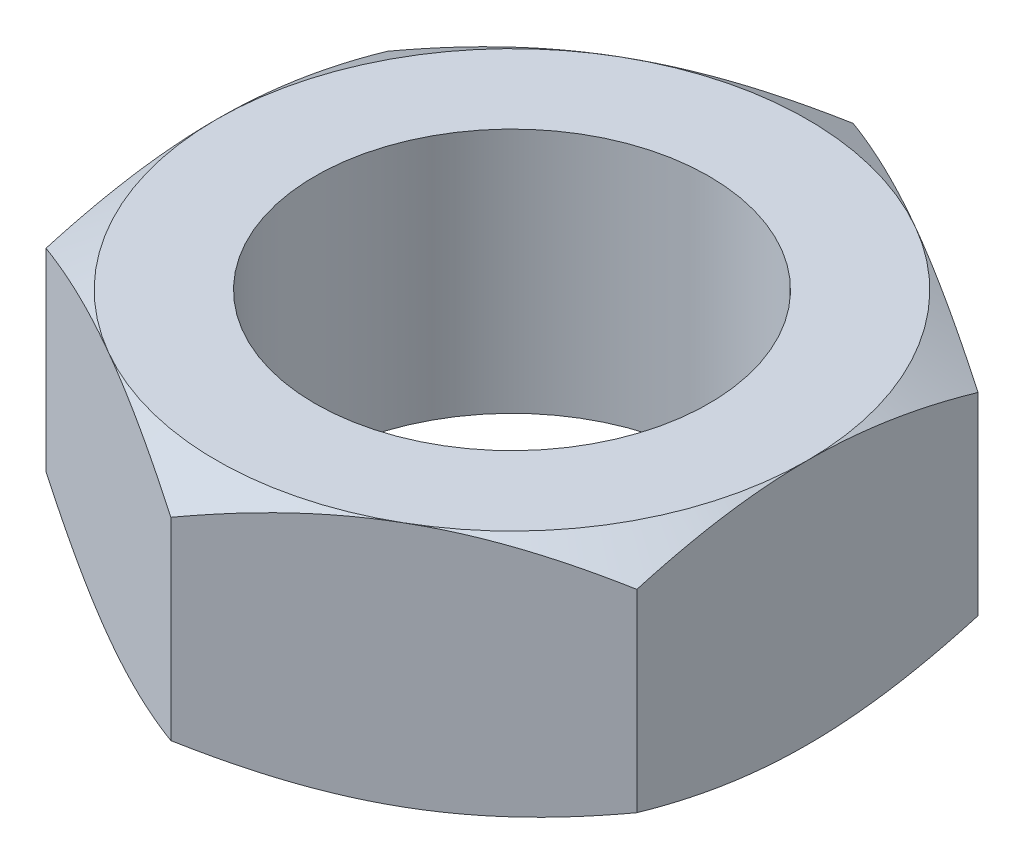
from build123d import *

# Parameters (mm, degrees)
SKETCH1_R               = 6.35
BOSS_EXTRUDE1_DEPTH     = 3.96875
SKETCH5_OUTSIDE_W       = 87.96
SKETCH5_OUTSIDE_H       = 90.908
SKETCH5_OUTSIDE_R       = 9.525
CUT_EXTRUDE2_DEPTH      = 17.573986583
CUT_EXTRUDE2_DRAFT      = -60
MIRROR1_COPY_1_SKETCH_W = 87.96
MIRROR1_COPY_1_SKETCH_H = 90.908
MIRROR1_COPY_1_SKETCH_R = 9.525
MIRROR1_COPY_1_DEPTH    = 17.573986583
MIRROR1_COPY_1_DRAFT    = -60


with BuildPart() as part:
    # Sketch1 → Boss-Extrude1 (new, symmetric)
    with BuildSketch(Plane(origin=(0, 0, 0), x_dir=(1, 0, 0), z_dir=(0, 1, 0))):
        Polygon((-9.525, 5.499261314), (-9.525, -5.499261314), (0, -10.998522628), (9.525, -5.499261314), (9.525, 5.499261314), (0, 10.998522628), align=None)
        with Locations(Location((0, 0, 0), (0, 0, 270))):
            Circle(SKETCH1_R, mode=Mode.SUBTRACT)
    extrude(amount=BOSS_EXTRUDE1_DEPTH, both=True)


with BuildPart() as cut_extrude2_tool:
    # Sketch5 outside → Cut-Extrude2 (with draft: the straight prism first)
    with BuildSketch(Plane(origin=(0, 3.96875, 0), x_dir=(1, 0, 0), z_dir=(0, 1, 0))):
        Rectangle(SKETCH5_OUTSIDE_W, SKETCH5_OUTSIDE_H)
        Circle(SKETCH5_OUTSIDE_R, mode=Mode.SUBTRACT)
    extrude(amount=-CUT_EXTRUDE2_DEPTH)
    # Cut-Extrude2: the draft: its side faces are tilted about the plane it starts from
    cut_extrude2_sides = [cut_extrude2_tool.faces().sort_by_distance(p)[0] for p in [
        (0, -4.818243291, 45.454),
        (43.98, -4.818243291, 0),
        (0, -4.818243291, -45.454),
        (-43.98, -4.818243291, 0),
        (-9.525, -4.818243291, 0),
    ]]
    draft(cut_extrude2_sides, Plane(origin=(0, 3.96875, 0), x_dir=(1, 0, 0), z_dir=(0, 1, 0)), CUT_EXTRUDE2_DRAFT)


with BuildPart() as part_1:
    add(part.part)

    # Cut-Extrude2: cut by cut_extrude2_tool
    add(cut_extrude2_tool.part, mode=Mode.SUBTRACT)


with BuildPart() as mirror1_copy_1_tool:
    # Mirror1 copy 1 sketch → Mirror1 copy 1 (with draft: the straight prism first)
    with BuildSketch(Plane.XZ.offset(3.96875)):
        Rectangle(MIRROR1_COPY_1_SKETCH_W, MIRROR1_COPY_1_SKETCH_H)
        Circle(MIRROR1_COPY_1_SKETCH_R, mode=Mode.SUBTRACT)
    extrude(amount=-MIRROR1_COPY_1_DEPTH)
    # Mirror1 copy 1: the draft: its side faces are tilted about the plane it starts from
    mirror1_copy_1_sides = [mirror1_copy_1_tool.faces().sort_by_distance(p)[0] for p in [
        (0, 4.818243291, 45.454),
        (43.98, 4.818243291, 0),
        (0, 4.818243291, -45.454),
        (-43.98, 4.818243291, 0),
        (-9.525, 4.818243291, 0),
    ]]
    draft(mirror1_copy_1_sides, Plane.XZ.offset(3.96875), MIRROR1_COPY_1_DRAFT)


with BuildPart() as part_2:
    add(part_1.part)

    # Mirror1 copy 1: cut by mirror1_copy_1_tool
    add(mirror1_copy_1_tool.part, mode=Mode.SUBTRACT)


solid = part_2.part
